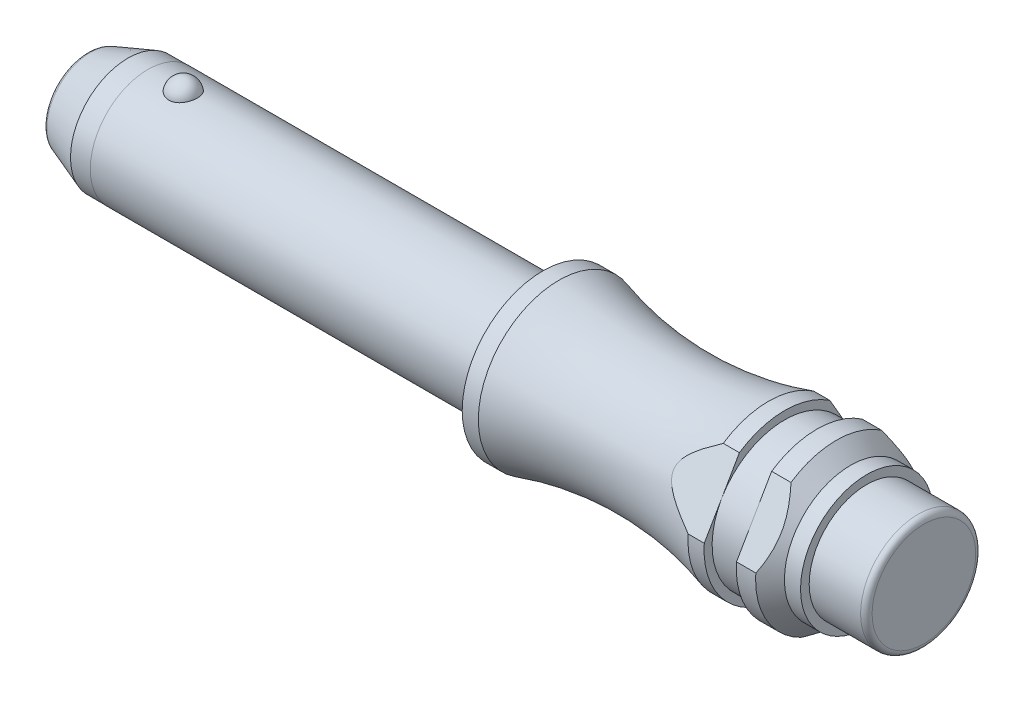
from build123d import *

# Parameters (mm, degrees)
SKETCH2_OUTSIDE_W   = 23.714
SKETCH2_OUTSIDE_H   = 23.714
EXTRUDE3_DEPTH      = 16.881
SKETCH3_R           = 5
BOSS_EXTRUDE1_DEPTH = 30
SKETCH3_2_R         = 5
BOSS_EXTRUDE2_DEPTH = 39.6
CHAMFER1_SIZE       = 3.6
CHAMFER1_SIZE2      = 1.310292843
FILLET1_R           = 0.5
SKETCH7_OUTSIDE_W   = 31.07
SKETCH7_OUTSIDE_H   = 31.07
SKETCH7_OUTSIDE_R   = 4.99
CUT_EXTRUDE2_DEPTH  = 5.3


with BuildPart() as part:
    # Sketch1 → Revolve1 (revolve)
    with BuildSketch(Plane.XY, mode=Mode.PRIVATE) as revolve1_sk:
        with BuildLine():
            Line((0, 0), (0, 7))
            Line((0, 7), (1.4, 7))
            ThreePointArc((1.4, 7), (10.5025, 5.67), (19.605, 7))
            Line((19.605, 7), (21.005, 7))
            Line((21.005, 7), (21.005, 6.3))
            Line((21.005, 6.3), (23.805, 6.3))
            Line((23.805, 6.3), (23.805, 7))
            Line((23.805, 7), (25.485, 7))
            Line((25.485, 7), (26.735, 5.75))
            Line((26.735, 5.75), (28.135, 5.75))
            Line((28.135, 5.75), (28.135, 5))
            Line((28.135, 5), (33.1, 5))
            Line((33.1, 5), (33.1, 0))
            Line((33.1, 0), (0, 0))
        make_face()
    revolve(revolve1_sk.sketch.rotate(Axis((0, 0, 0), (1, 0, 0)), 90), axis=Axis((0, 0, 0), (1, 0, 0)))

    # Sketch2 outside → Extrude3 (cut)
    with BuildSketch(Plane(origin=(28.135, 0, 0), x_dir=(0, 0, -1), z_dir=(1, 0, 0))):
        Rectangle(SKETCH2_OUTSIDE_W, SKETCH2_OUTSIDE_H)
        Polygon((0, 12.6), (10.911920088, -6.3), (-10.911920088, -6.3), align=None, mode=Mode.SUBTRACT)
    extrude(amount=-EXTRUDE3_DEPTH, mode=Mode.SUBTRACT)

    # Sketch3 → Boss-Extrude1 (add)
    with BuildSketch(Plane.ZY):
        Circle(SKETCH3_R)
    extrude(amount=BOSS_EXTRUDE1_DEPTH)

    # Sketch4 → Revolve2 (revolve)
    with BuildSketch(Plane.XY):
        with BuildLine():
            Line((-29.974744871, -4.75), (-29.974744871, 4.75))
            ThreePointArc((-29.974744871, 4.75), (-30.340861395, 5.633883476), (-31.224744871, 6))
            Line((-31.224744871, 6), (-31.224744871, -6))
            ThreePointArc((-31.224744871, -6), (-30.340861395, -5.633883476), (-29.974744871, -4.75))
        make_face()
    revolve(axis=Axis((-31.224744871, 6, 0), (0, -1, 0)))

    # Sketch3_2 → Boss-Extrude2 (add)
    with BuildSketch(Plane.ZY):
        Circle(SKETCH3_2_R)
    extrude(amount=BOSS_EXTRUDE2_DEPTH)

    # Chamfer1
    chamfer1_edges = [part.edges().sort_by_distance(p)[0] for p in [
        (-39.6, 0, -5),
    ]]
    chamfer1_side = [part.faces().sort_by_distance(p)[0] for p in [
        (-19.8, 0, -5),
    ]]
    chamfer(chamfer1_edges, length=CHAMFER1_SIZE, length2=CHAMFER1_SIZE2, reference=chamfer1_side[0])

    # Fillet1
    fillet1_edges = [part.edges().sort_by_distance(p)[0] for p in [
        (-39.6, 0, -3.689707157),
        (33.1, 0, -5),
    ]]
    fillet(fillet1_edges, radius=FILLET1_R)

    # Sketch7 outside → Cut-Extrude2 (cut)
    with BuildSketch(Plane.ZY.offset(39.6)):
        Rectangle(SKETCH7_OUTSIDE_W, SKETCH7_OUTSIDE_H)
        Circle(SKETCH7_OUTSIDE_R, mode=Mode.SUBTRACT)
    extrude(amount=-CUT_EXTRUDE2_DEPTH, mode=Mode.SUBTRACT)


solid = part.part
